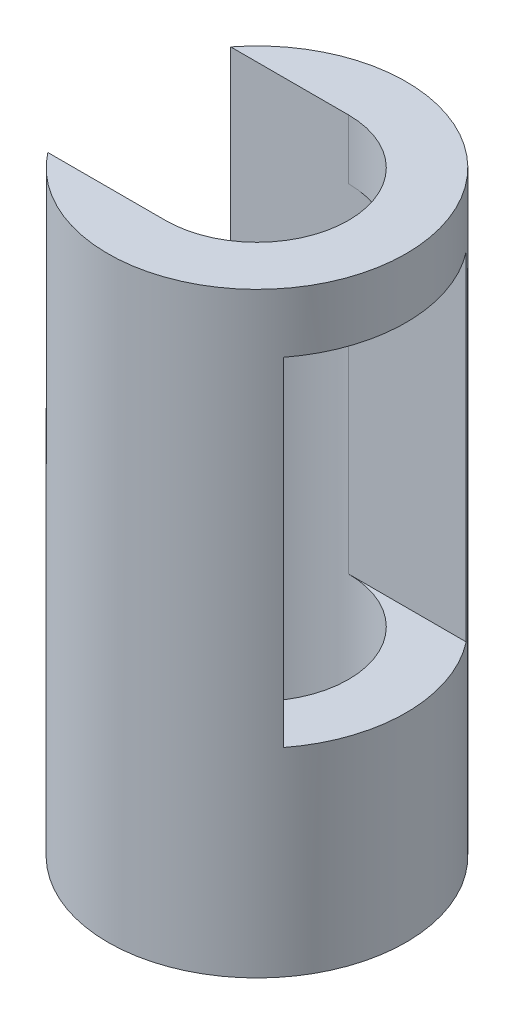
ISO-10303-21;
HEADER;
FILE_DESCRIPTION(('STEP AP214'),'2;1');
FILE_NAME('part.step','',(''),(''),'','','');
FILE_SCHEMA(('AUTOMOTIVE_DESIGN { 1 0 10303 214 1 1 1 1 }'));
ENDSEC;
DATA;
#1=APPLICATION_CONTEXT('core data for automotive mechanical design processes');
#2=APPLICATION_PROTOCOL_DEFINITION('international standard','automotive_design',2000,#1);
#3=PRODUCT_CONTEXT('',#1,'mechanical');
#4=PRODUCT('Part','Part','',(#3));
#5=PRODUCT_RELATED_PRODUCT_CATEGORY('part','',(#4));
#6=PRODUCT_DEFINITION_FORMATION('','',#4);
#7=PRODUCT_DEFINITION_CONTEXT('part definition',#1,'design');
#8=PRODUCT_DEFINITION('design','',#6,#7);
#9=PRODUCT_DEFINITION_SHAPE('','',#8);
#10=(LENGTH_UNIT() NAMED_UNIT(*) SI_UNIT(.MILLI.,.METRE.));
#11=(NAMED_UNIT(*) PLANE_ANGLE_UNIT() SI_UNIT($,.RADIAN.));
#12=(NAMED_UNIT(*) SI_UNIT($,.STERADIAN.) SOLID_ANGLE_UNIT());
#13=UNCERTAINTY_MEASURE_WITH_UNIT(LENGTH_MEASURE(1.E-05),#10,'distance_accuracy_value','');
#14=(GEOMETRIC_REPRESENTATION_CONTEXT(3) GLOBAL_UNCERTAINTY_ASSIGNED_CONTEXT((#13)) GLOBAL_UNIT_ASSIGNED_CONTEXT((#10,
#11,#12)) REPRESENTATION_CONTEXT('',''));
#15=CARTESIAN_POINT('',(0.,0.,0.));
#16=DIRECTION('',(0.,0.,1.));
#17=DIRECTION('',(1.,0.,0.));
#18=AXIS2_PLACEMENT_3D('',#15,#16,#17);
#19=CARTESIAN_POINT('',(0.,10.,0.));
#20=DIRECTION('',(0.,-1.,0.));
#21=DIRECTION('',(0.,0.,-1.));
#22=AXIS2_PLACEMENT_3D('',#19,#20,#21);
#23=CYLINDRICAL_SURFACE('',#22,4.6);
#24=CARTESIAN_POINT('',(0.,30.,0.));
#25=DIRECTION('',(0.,-1.,0.));
#26=DIRECTION('',(0.,0.,1.));
#27=AXIS2_PLACEMENT_3D('',#24,#25,#26);
#28=CIRCLE('',#27,4.6);
#29=CARTESIAN_POINT('',(0.,30.,-4.6));
#30=VERTEX_POINT('',#29);
#31=CARTESIAN_POINT('',(0.,30.,4.6));
#32=VERTEX_POINT('',#31);
#33=EDGE_CURVE('E247',#30,#32,#28,.T.);
#34=ORIENTED_EDGE('',*,*,#33,.F.);
#35=DIRECTION('',(0.,1.,0.));
#36=VECTOR('',#35,1.);
#37=CARTESIAN_POINT('',(0.,21.,-4.6));
#38=LINE('',#37,#36);
#39=CARTESIAN_POINT('',(0.,27.,-4.6));
#40=VERTEX_POINT('',#39);
#41=EDGE_CURVE('E148',#40,#30,#38,.T.);
#42=ORIENTED_EDGE('',*,*,#41,.F.);
#43=CARTESIAN_POINT('',(0.,27.,0.));
#44=DIRECTION('',(0.,-1.,0.));
#45=DIRECTION('',(0.,0.,1.));
#46=AXIS2_PLACEMENT_3D('',#43,#44,#45);
#47=CIRCLE('',#46,4.6);
#48=CARTESIAN_POINT('',(0.,27.,4.6));
#49=VERTEX_POINT('',#48);
#50=EDGE_CURVE('E249',#40,#49,#47,.T.);
#51=ORIENTED_EDGE('',*,*,#50,.T.);
#52=DIRECTION('',(0.,1.,0.));
#53=VECTOR('',#52,1.);
#54=CARTESIAN_POINT('',(0.,21.,4.6));
#55=LINE('',#54,#53);
#56=EDGE_CURVE('E144',#49,#32,#55,.T.);
#57=ORIENTED_EDGE('',*,*,#56,.T.);
#58=EDGE_LOOP('',(#34,#42,#51,#57));
#59=FACE_BOUND('',#58,.T.);
#60=ADVANCED_FACE('F35',(#59),#23,.F.);
#61=CARTESIAN_POINT('',(0.,0.,0.));
#62=DIRECTION('',(0.,1.,0.));
#63=DIRECTION('',(0.,0.,1.));
#64=AXIS2_PLACEMENT_3D('',#61,#62,#63);
#65=CIRCLE('',#64,4.6);
#66=CARTESIAN_POINT('',(0.,0.,4.6));
#67=VERTEX_POINT('',#66);
#68=EDGE_CURVE('E203',#67,#67,#65,.T.);
#69=ORIENTED_EDGE('',*,*,#68,.F.);
#70=EDGE_LOOP('',(#69));
#71=FACE_BOUND('',#70,.T.);
#72=DIRECTION('',(0.,-1.,0.));
#73=VECTOR('',#72,1.);
#74=CARTESIAN_POINT('',(0.,41.8697093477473,-4.6));
#75=LINE('',#74,#73);
#76=CARTESIAN_POINT('',(0.,21.,-4.6));
#77=VERTEX_POINT('',#76);
#78=CARTESIAN_POINT('',(0.,10.,-4.6));
#79=VERTEX_POINT('',#78);
#80=EDGE_CURVE('E234',#77,#79,#75,.T.);
#81=ORIENTED_EDGE('',*,*,#80,.F.);
#82=CARTESIAN_POINT('',(0.,21.,0.));
#83=DIRECTION('',(0.,-1.,0.));
#84=DIRECTION('',(0.,0.,1.));
#85=AXIS2_PLACEMENT_3D('',#82,#83,#84);
#86=CIRCLE('',#85,4.6);
#87=CARTESIAN_POINT('',(-0.802584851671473,21.,-4.52944340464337));
#88=VERTEX_POINT('',#87);
#89=EDGE_CURVE('E137',#88,#77,#86,.T.);
#90=ORIENTED_EDGE('',*,*,#89,.F.);
#91=CARTESIAN_POINT('',(0.,22.,0.));
#92=DIRECTION('',(0.779884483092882,-0.625923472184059,0.));
#93=DIRECTION('',(-0.625923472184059,-0.779884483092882,0.));
#94=AXIS2_PLACEMENT_3D('',#91,#92,#93);
#95=ELLIPSE('',#94,7.34914123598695,4.6);
#96=CARTESIAN_POINT('',(-0.802584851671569,21.,4.52944340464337));
#97=VERTEX_POINT('',#96);
#98=EDGE_CURVE('E222',#88,#97,#95,.F.);
#99=ORIENTED_EDGE('',*,*,#98,.T.);
#100=CARTESIAN_POINT('',(0.,21.,4.6));
#101=VERTEX_POINT('',#100);
#102=EDGE_CURVE('E60',#101,#97,#86,.T.);
#103=ORIENTED_EDGE('',*,*,#102,.F.);
#104=DIRECTION('',(0.,-1.,0.));
#105=VECTOR('',#104,1.);
#106=CARTESIAN_POINT('',(0.,41.8697093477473,4.6));
#107=LINE('',#106,#105);
#108=CARTESIAN_POINT('',(0.,10.,4.6));
#109=VERTEX_POINT('',#108);
#110=EDGE_CURVE('E160',#101,#109,#107,.T.);
#111=ORIENTED_EDGE('',*,*,#110,.T.);
#112=CARTESIAN_POINT('',(0.,10.,0.));
#113=DIRECTION('',(0.,1.,0.));
#114=DIRECTION('',(0.,0.,1.));
#115=AXIS2_PLACEMENT_3D('',#112,#113,#114);
#116=CIRCLE('',#115,4.6);
#117=EDGE_CURVE('E205',#109,#79,#116,.T.);
#118=ORIENTED_EDGE('',*,*,#117,.T.);
#119=EDGE_LOOP('',(#81,#90,#99,#103,#111,#118));
#120=FACE_BOUND('',#119,.T.);
#121=ADVANCED_FACE('F168',(#71,#120),#23,.F.);
#122=CARTESIAN_POINT('',(2.6734191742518,22.5926827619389,0.));
#123=DIRECTION('',(-0.976296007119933,-0.216439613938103,0.));
#124=DIRECTION('',(0.216439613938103,-0.976296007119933,0.));
#125=AXIS2_PLACEMENT_3D('',#122,#123,#124);
#126=CYLINDRICAL_SURFACE('',#125,4.6);
#127=CARTESIAN_POINT('',(-7.5,15.6256042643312,0.));
#128=CARTESIAN_POINT('',(-7.50000050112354,15.6256035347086,0.109330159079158));
#129=CARTESIAN_POINT('',(-7.49760368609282,15.6301342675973,0.218652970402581));
#130=CARTESIAN_POINT('',(-7.48808684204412,15.648162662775,0.436388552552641));
#131=CARTESIAN_POINT('',(-7.48096505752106,15.6616636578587,0.544800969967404));
#132=CARTESIAN_POINT('',(-7.46219761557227,15.6973661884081,0.759763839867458));
#133=CARTESIAN_POINT('',(-7.45055272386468,15.7195662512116,0.866314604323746));
#134=CARTESIAN_POINT('',(-7.42305678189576,15.7722457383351,1.0768118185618));
#135=CARTESIAN_POINT('',(-7.40720377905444,15.8027290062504,1.18075703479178));
#136=CARTESIAN_POINT('',(-7.35414712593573,15.9053932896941,1.48623704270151));
#137=CARTESIAN_POINT('',(-7.31129370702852,15.9890716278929,1.68305123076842));
#138=CARTESIAN_POINT('',(-7.21417368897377,16.1825436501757,2.06004871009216));
#139=CARTESIAN_POINT('',(-7.15990032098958,16.2923528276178,2.24022204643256));
#140=CARTESIAN_POINT('',(-7.02178055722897,16.5794395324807,2.64695346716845));
#141=CARTESIAN_POINT('',(-6.93448923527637,16.7665586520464,2.86546750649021));
#142=CARTESIAN_POINT('',(-6.79981491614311,17.0717466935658,3.16617795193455));
#143=CARTESIAN_POINT('',(-6.75423309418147,17.1777291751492,3.26202160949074));
#144=CARTESIAN_POINT('',(-6.66293067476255,17.3972124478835,3.44467030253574));
#145=CARTESIAN_POINT('',(-6.61721008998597,17.5107125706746,3.53147613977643));
#146=CARTESIAN_POINT('',(-6.5261265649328,17.7463213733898,3.69712703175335));
#147=CARTESIAN_POINT('',(-6.48077938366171,17.8685339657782,3.77583248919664));
#148=CARTESIAN_POINT('',(-6.39241425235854,18.1194979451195,3.92357564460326));
#149=CARTESIAN_POINT('',(-6.34939655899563,18.2482500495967,3.99261227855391));
#150=CARTESIAN_POINT('',(-6.26711812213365,18.5116241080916,4.1205595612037));
#151=CARTESIAN_POINT('',(-6.2278520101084,18.6462372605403,4.17948477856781));
#152=CARTESIAN_POINT('',(-6.1544799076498,18.9209546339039,4.28679281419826));
#153=CARTESIAN_POINT('',(-6.12037476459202,19.0610597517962,4.33517390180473));
#154=CARTESIAN_POINT('',(-6.04227288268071,19.423498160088,4.44382782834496));
#155=CARTESIAN_POINT('',(-6.00290228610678,19.649322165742,4.49638051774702));
#156=CARTESIAN_POINT('',(-5.96034047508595,19.9935218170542,4.55245610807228));
#157=CARTESIAN_POINT('',(-5.94890267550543,20.1091487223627,4.56735522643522));
#158=CARTESIAN_POINT('',(-5.93211342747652,20.3415842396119,4.58914281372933));
#159=CARTESIAN_POINT('',(-5.926759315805,20.4583923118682,4.5960347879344));
#160=CARTESIAN_POINT('',(-5.92257430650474,20.6933055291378,4.60142642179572));
#161=CARTESIAN_POINT('',(-5.92379837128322,20.8114133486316,4.59985537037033));
#162=CARTESIAN_POINT('',(-5.93309849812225,21.046916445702,4.58785362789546));
#163=CARTESIAN_POINT('',(-5.94117450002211,21.1643117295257,4.57742301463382));
#164=CARTESIAN_POINT('',(-5.96406209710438,21.3972858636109,4.54756145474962));
#165=CARTESIAN_POINT('',(-5.97887361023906,21.5128647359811,4.52813061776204));
#166=CARTESIAN_POINT('',(-6.01478824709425,21.7411474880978,4.48031404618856));
#167=CARTESIAN_POINT('',(-6.0358910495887,21.8538515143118,4.45192876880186));
#168=CARTESIAN_POINT('',(-6.08093608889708,22.0628037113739,4.39015939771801));
#169=CARTESIAN_POINT('',(-6.10427907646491,22.159461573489,4.35771601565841));
#170=CARTESIAN_POINT('',(-6.15470527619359,22.3492995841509,4.28620107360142));
#171=CARTESIAN_POINT('',(-6.18178971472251,22.442478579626,4.24712733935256));
#172=CARTESIAN_POINT('',(-6.26761741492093,22.7161336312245,4.12036003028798));
#173=CARTESIAN_POINT('',(-6.33095925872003,22.8908342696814,4.02308861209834));
#174=CARTESIAN_POINT('',(-6.47012006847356,23.237445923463,3.79563877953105));
#175=CARTESIAN_POINT('',(-6.54654998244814,23.4076540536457,3.66327030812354));
#176=CARTESIAN_POINT('',(-6.70024649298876,23.725494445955,3.37394384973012));
#177=CARTESIAN_POINT('',(-6.77751353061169,23.8731141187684,3.21697224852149));
#178=CARTESIAN_POINT('',(-6.8949418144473,24.0863671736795,2.95311832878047));
#179=CARTESIAN_POINT('',(-6.9368692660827,24.1601086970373,2.85343912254));
#180=CARTESIAN_POINT('',(-7.01803726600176,24.2994460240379,2.64752294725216));
#181=CARTESIAN_POINT('',(-7.05727861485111,24.3650442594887,2.54128795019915));
#182=CARTESIAN_POINT('',(-7.13218023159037,24.4878443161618,2.32279034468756));
#183=CARTESIAN_POINT('',(-7.16783858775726,24.5450416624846,2.2105245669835));
#184=CARTESIAN_POINT('',(-7.23471024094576,24.6506713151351,1.98072670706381));
#185=CARTESIAN_POINT('',(-7.2659254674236,24.6991074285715,1.8631969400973));
#186=CARTESIAN_POINT('',(-7.32347615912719,24.7873628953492,1.62239649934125));
#187=CARTESIAN_POINT('',(-7.34976045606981,24.8270925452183,1.49908063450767));
#188=CARTESIAN_POINT('',(-7.39640976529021,24.8970006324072,1.24873009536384));
#189=CARTESIAN_POINT('',(-7.4167772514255,24.927183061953,1.12169699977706));
#190=CARTESIAN_POINT('',(-7.45109253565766,24.9777504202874,0.864869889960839));
#191=CARTESIAN_POINT('',(-7.46504179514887,24.9981375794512,0.735076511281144));
#192=CARTESIAN_POINT('',(-7.48616865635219,25.0289291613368,0.473768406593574));
#193=CARTESIAN_POINT('',(-7.49334673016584,25.0393342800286,0.342253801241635));
#194=CARTESIAN_POINT('',(-7.50048932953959,25.0496864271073,0.0878206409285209));
#195=CARTESIAN_POINT('',(-7.50092196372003,25.0503121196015,-0.035057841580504));
#196=CARTESIAN_POINT('',(-7.49575918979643,25.0428316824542,-0.280464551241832));
#197=CARTESIAN_POINT('',(-7.49016177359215,25.034722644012,-0.402992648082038));
#198=CARTESIAN_POINT('',(-7.4730651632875,25.0098439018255,-0.646692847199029));
#199=CARTESIAN_POINT('',(-7.4615685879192,24.993078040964,-0.767865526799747));
#200=CARTESIAN_POINT('',(-7.43292677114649,24.9510211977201,-1.00808717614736));
#201=CARTESIAN_POINT('',(-7.41577940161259,24.9257270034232,-1.1271353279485));
#202=CARTESIAN_POINT('',(-7.37655511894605,24.8673231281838,-1.36020139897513));
#203=CARTESIAN_POINT('',(-7.35456960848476,24.8343577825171,-1.47427087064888));
#204=CARTESIAN_POINT('',(-7.3059649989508,24.7606109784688,-1.69885456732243));
#205=CARTESIAN_POINT('',(-7.27934423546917,24.7198267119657,-1.80936749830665));
#206=CARTESIAN_POINT('',(-7.19331695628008,24.5861073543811,-2.13454757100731));
#207=CARTESIAN_POINT('',(-7.12771355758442,24.4817598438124,-2.34303831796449));
#208=CARTESIAN_POINT('',(-6.98096042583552,24.2376822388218,-2.75063314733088));
#209=CARTESIAN_POINT('',(-6.89911622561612,24.0962112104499,-2.94843302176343));
#210=CARTESIAN_POINT('',(-6.72993335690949,23.7831629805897,-3.31646979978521));
#211=CARTESIAN_POINT('',(-6.64258974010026,23.6115584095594,-3.48668137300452));
#212=CARTESIAN_POINT('',(-6.51214714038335,23.3288480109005,-3.72163337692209));
#213=CARTESIAN_POINT('',(-6.46777126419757,23.227809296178,-3.79802154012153));
#214=CARTESIAN_POINT('',(-6.38138193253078,23.0183746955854,-3.94143982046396));
#215=CARTESIAN_POINT('',(-6.33936728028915,22.9099825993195,-4.00847470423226));
#216=CARTESIAN_POINT('',(-6.25922431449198,22.6864072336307,-4.13250126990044));
#217=CARTESIAN_POINT('',(-6.2210915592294,22.5712319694,-4.18950448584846));
#218=CARTESIAN_POINT('',(-6.15017123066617,22.3346517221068,-4.29293955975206));
#219=CARTESIAN_POINT('',(-6.11738259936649,22.2132479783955,-4.33937351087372));
#220=CARTESIAN_POINT('',(-6.06162458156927,21.9781005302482,-4.41687059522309));
#221=CARTESIAN_POINT('',(-6.03798812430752,21.8648762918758,-4.44903103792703));
#222=CARTESIAN_POINT('',(-5.99697427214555,21.6351052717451,-4.50416281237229));
#223=CARTESIAN_POINT('',(-5.97959631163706,21.5185587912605,-4.52713497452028));
#224=CARTESIAN_POINT('',(-5.9516882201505,21.2832768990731,-4.56376428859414));
#225=CARTESIAN_POINT('',(-5.94115360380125,21.1645429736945,-4.57742754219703));
#226=CARTESIAN_POINT('',(-5.92714125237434,20.9259988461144,-4.59555328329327));
#227=CARTESIAN_POINT('',(-5.92366321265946,20.8061886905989,-4.60001616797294));
#228=CARTESIAN_POINT('',(-5.92371281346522,20.4775509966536,-4.59997178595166));
#229=CARTESIAN_POINT('',(-5.9343540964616,20.2686396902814,-4.58635086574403));
#230=CARTESIAN_POINT('',(-5.97424200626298,19.8559112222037,-4.53424882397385));
#231=CARTESIAN_POINT('',(-6.00350477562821,19.6520986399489,-4.49574613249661));
#232=CARTESIAN_POINT('',(-6.09189438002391,19.1690721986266,-4.37566769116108));
#233=CARTESIAN_POINT('',(-6.15839175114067,18.8939562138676,-4.28281421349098));
#234=CARTESIAN_POINT('',(-6.27117761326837,18.4978773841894,-4.11423159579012));
#235=CARTESIAN_POINT('',(-6.31101343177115,18.3684414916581,-4.05304363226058));
#236=CARTESIAN_POINT('',(-6.39374911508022,18.1154468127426,-3.92122803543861));
#237=CARTESIAN_POINT('',(-6.43664866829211,17.9918874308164,-3.85060136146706));
#238=CARTESIAN_POINT('',(-6.52507162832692,17.7489424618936,-3.69882308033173));
#239=CARTESIAN_POINT('',(-6.57062872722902,17.6296749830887,-3.6175022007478));
#240=CARTESIAN_POINT('',(-6.66239653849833,17.3983383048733,-3.44557378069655));
#241=CARTESIAN_POINT('',(-6.70860730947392,17.2862697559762,-3.35496540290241));
#242=CARTESIAN_POINT('',(-6.84632452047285,16.9621611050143,-3.06958768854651));
#243=CARTESIAN_POINT('',(-6.93713359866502,16.7616440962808,-2.86091006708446));
#244=CARTESIAN_POINT('',(-7.09005691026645,16.4360780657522,-2.45325164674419));
#245=CARTESIAN_POINT('',(-7.15427212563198,16.3039596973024,-2.26073261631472));
#246=CARTESIAN_POINT('',(-7.24117055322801,16.1286630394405,-1.95617576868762));
#247=CARTESIAN_POINT('',(-7.26857201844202,16.0740327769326,-1.8519971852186));
#248=CARTESIAN_POINT('',(-7.31958841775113,15.973165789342,-1.63878712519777));
#249=CARTESIAN_POINT('',(-7.3432050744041,15.9269252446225,-1.52975788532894));
#250=CARTESIAN_POINT('',(-7.38620509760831,15.8432646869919,-1.30652079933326));
#251=CARTESIAN_POINT('',(-7.40555331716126,15.805917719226,-1.19227867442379));
#252=CARTESIAN_POINT('',(-7.43918867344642,15.7412832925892,-0.960309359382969));
#253=CARTESIAN_POINT('',(-7.45347863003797,15.7139902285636,-0.842584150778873));
#254=CARTESIAN_POINT('',(-7.47653758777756,15.6700655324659,-0.604694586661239));
#255=CARTESIAN_POINT('',(-7.48530999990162,15.6534273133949,-0.484531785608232));
#256=CARTESIAN_POINT('',(-7.49704058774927,15.6311977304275,-0.242909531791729));
#257=CARTESIAN_POINT('',(-7.49999944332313,15.625605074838,-0.121450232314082));
#258=CARTESIAN_POINT('',(-7.5,15.6256042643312,0.));
#259=B_SPLINE_CURVE_WITH_KNOTS('',3,(#127,#128,#129,#130,#131,#132,#133,#134,#135,#136,#137,
#138,#139,#140,#141,#142,#143,#144,#145,#146,#147,#148,#149,#150,#151,#152,#153,#154,#155,#156,
#157,#158,#159,#160,#161,#162,#163,#164,#165,#166,#167,#168,#169,#170,#171,#172,#173,#174,#175,
#176,#177,#178,#179,#180,#181,#182,#183,#184,#185,#186,#187,#188,#189,#190,#191,#192,#193,#194,
#195,#196,#197,#198,#199,#200,#201,#202,#203,#204,#205,#206,#207,#208,#209,#210,#211,#212,#213,
#214,#215,#216,#217,#218,#219,#220,#221,#222,#223,#224,#225,#226,#227,#228,#229,#230,#231,#232,
#233,#234,#235,#236,#237,#238,#239,#240,#241,#242,#243,#244,#245,#246,#247,#248,#249,#250,#251,
#252,#253,#254,#255,#256,#257,#258),.UNSPECIFIED.,.T.,.F.,(4,2,2,2,2,2,2,2,2,2,2,2,2,2,2,2,2,2,
2,2,2,2,2,2,2,2,2,2,2,2,2,2,2,2,2,2,2,2,2,2,2,2,2,2,2,2,2,2,2,2,2,2,2,2,2,2,2,2,2,2,2,2,2,2,2,
4),(0.,0.327858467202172,0.655838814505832,0.983763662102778,1.31184093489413,1.96306234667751,
2.61467084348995,3.51137569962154,3.96100877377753,4.4106019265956,4.86696680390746,
5.32338186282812,5.77913368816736,6.23496026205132,6.9373142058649,7.28839082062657,
7.63931368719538,7.99317314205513,8.34702949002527,8.7008815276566,9.05471550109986,
9.36815222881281,9.68169193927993,10.3084338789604,10.9922516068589,11.6764490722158,
12.0687326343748,12.4608987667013,12.853273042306,13.2454764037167,13.6415482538,
14.0374542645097,14.4332700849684,14.8290583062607,15.197247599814,15.565559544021,
15.9337081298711,16.3019955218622,16.6638455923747,17.0258258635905,17.7492208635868,
18.5158182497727,19.2831155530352,19.6853058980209,20.0872905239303,20.4888098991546,
20.8902496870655,21.2498711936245,21.6094601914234,21.9688132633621,22.3281508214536,
22.9541329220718,23.5806584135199,24.4691022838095,24.9146173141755,25.3600870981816,
25.813726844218,26.2674075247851,27.1726631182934,27.8962060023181,28.2581707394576,
28.6199702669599,28.984646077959,29.3491182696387,29.7133649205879,30.0775689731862),.UNSPECIFIED.);
#260=CARTESIAN_POINT('',(-5.93165972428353,21.,-4.58970727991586));
#261=VERTEX_POINT('',#260);
#262=CARTESIAN_POINT('',(-5.93165972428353,21.,4.58970727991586));
#263=VERTEX_POINT('',#262);
#264=EDGE_CURVE('E155',#261,#263,#259,.T.);
#265=ORIENTED_EDGE('',*,*,#264,.T.);
#266=CARTESIAN_POINT('',(-4.51070850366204,21.,0.));
#267=DIRECTION('',(0.,1.,0.));
#268=DIRECTION('',(-1.,0.,0.));
#269=AXIS2_PLACEMENT_3D('',#266,#267,#268);
#270=ELLIPSE('',#269,21.2530410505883,4.6);
#271=CARTESIAN_POINT('',(-4.51070850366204,21.,4.6));
#272=VERTEX_POINT('',#271);
#273=EDGE_CURVE('E11',#263,#272,#270,.T.);
#274=ORIENTED_EDGE('',*,*,#273,.T.);
#275=EDGE_CURVE('E45',#272,#97,#270,.T.);
#276=ORIENTED_EDGE('',*,*,#275,.T.);
#277=ORIENTED_EDGE('',*,*,#98,.F.);
#278=CARTESIAN_POINT('',(-4.51070850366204,21.,-4.6));
#279=VERTEX_POINT('',#278);
#280=EDGE_CURVE('E227',#88,#279,#270,.T.);
#281=ORIENTED_EDGE('',*,*,#280,.T.);
#282=EDGE_CURVE('E40',#279,#261,#270,.T.);
#283=ORIENTED_EDGE('',*,*,#282,.T.);
#284=EDGE_LOOP('',(#265,#274,#276,#277,#281,#283));
#285=FACE_BOUND('',#284,.T.);
#286=ADVANCED_FACE('F163',(#285),#126,.F.);
#287=CARTESIAN_POINT('',(0.,10.,0.));
#288=DIRECTION('',(0.,-1.,0.));
#289=DIRECTION('',(0.,0.,-1.));
#290=AXIS2_PLACEMENT_3D('',#287,#288,#289);
#291=CYLINDRICAL_SURFACE('',#290,7.5);
#292=CARTESIAN_POINT('',(0.,0.,0.));
#293=DIRECTION('',(0.,1.,0.));
#294=DIRECTION('',(0.,0.,1.));
#295=AXIS2_PLACEMENT_3D('',#292,#293,#294);
#296=CIRCLE('',#295,7.5);
#297=CARTESIAN_POINT('',(0.,0.,7.5));
#298=VERTEX_POINT('',#297);
#299=EDGE_CURVE('E200',#298,#298,#296,.T.);
#300=ORIENTED_EDGE('',*,*,#299,.T.);
#301=EDGE_LOOP('',(#300));
#302=FACE_BOUND('',#301,.T.);
#303=CARTESIAN_POINT('',(0.,21.,0.));
#304=DIRECTION('',(0.,1.,0.));
#305=DIRECTION('',(0.,0.,1.));
#306=AXIS2_PLACEMENT_3D('',#303,#304,#305);
#307=CIRCLE('',#306,7.5);
#308=CARTESIAN_POINT('',(-5.92368128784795,21.,-4.6));
#309=VERTEX_POINT('',#308);
#310=EDGE_CURVE('E52',#309,#261,#307,.T.);
#311=ORIENTED_EDGE('',*,*,#310,.F.);
#312=DIRECTION('',(0.,1.,0.));
#313=VECTOR('',#312,1.);
#314=CARTESIAN_POINT('',(-5.92368128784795,21.,-4.6));
#315=LINE('',#314,#313);
#316=CARTESIAN_POINT('',(-5.92368128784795,30.,-4.6));
#317=VERTEX_POINT('',#316);
#318=EDGE_CURVE('E161',#309,#317,#315,.T.);
#319=ORIENTED_EDGE('',*,*,#318,.T.);
#320=CARTESIAN_POINT('',(0.,30.,0.));
#321=DIRECTION('',(0.,1.,0.));
#322=DIRECTION('',(0.,0.,1.));
#323=AXIS2_PLACEMENT_3D('',#320,#321,#322);
#324=CIRCLE('',#323,7.5);
#325=CARTESIAN_POINT('',(-5.92368128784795,30.,4.6));
#326=VERTEX_POINT('',#325);
#327=EDGE_CURVE('E143',#326,#317,#324,.T.);
#328=ORIENTED_EDGE('',*,*,#327,.F.);
#329=DIRECTION('',(0.,1.,0.));
#330=VECTOR('',#329,1.);
#331=CARTESIAN_POINT('',(-5.92368128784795,21.,4.6));
#332=LINE('',#331,#330);
#333=CARTESIAN_POINT('',(-5.92368128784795,21.,4.6));
#334=VERTEX_POINT('',#333);
#335=EDGE_CURVE('E133',#334,#326,#332,.T.);
#336=ORIENTED_EDGE('',*,*,#335,.F.);
#337=EDGE_CURVE('E120',#263,#334,#307,.T.);
#338=ORIENTED_EDGE('',*,*,#337,.F.);
#339=ORIENTED_EDGE('',*,*,#264,.F.);
#340=EDGE_LOOP('',(#311,#319,#328,#336,#338,#339));
#341=FACE_BOUND('',#340,.T.);
#342=CARTESIAN_POINT('',(0.,27.,0.));
#343=DIRECTION('',(0.,1.,0.));
#344=DIRECTION('',(0.,0.,1.));
#345=AXIS2_PLACEMENT_3D('',#342,#343,#344);
#346=CIRCLE('',#345,7.5);
#347=CARTESIAN_POINT('',(5.92368128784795,27.,4.6));
#348=VERTEX_POINT('',#347);
#349=CARTESIAN_POINT('',(5.92368128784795,27.,-4.6));
#350=VERTEX_POINT('',#349);
#351=EDGE_CURVE('E243',#348,#350,#346,.T.);
#352=ORIENTED_EDGE('',*,*,#351,.T.);
#353=DIRECTION('',(0.,-1.,0.));
#354=VECTOR('',#353,1.);
#355=CARTESIAN_POINT('',(5.92368128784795,30.,-4.6));
#356=LINE('',#355,#354);
#357=CARTESIAN_POINT('',(5.92368128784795,10.,-4.6));
#358=VERTEX_POINT('',#357);
#359=EDGE_CURVE('E206',#350,#358,#356,.T.);
#360=ORIENTED_EDGE('',*,*,#359,.T.);
#361=CARTESIAN_POINT('',(0.,10.,0.));
#362=DIRECTION('',(0.,1.,0.));
#363=DIRECTION('',(0.,0.,1.));
#364=AXIS2_PLACEMENT_3D('',#361,#362,#363);
#365=CIRCLE('',#364,7.5);
#366=CARTESIAN_POINT('',(5.92368128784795,10.,4.6));
#367=VERTEX_POINT('',#366);
#368=EDGE_CURVE('E214',#367,#358,#365,.T.);
#369=ORIENTED_EDGE('',*,*,#368,.F.);
#370=DIRECTION('',(0.,-1.,0.));
#371=VECTOR('',#370,1.);
#372=CARTESIAN_POINT('',(5.92368128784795,30.,4.6));
#373=LINE('',#372,#371);
#374=EDGE_CURVE('E242',#348,#367,#373,.T.);
#375=ORIENTED_EDGE('',*,*,#374,.F.);
#376=EDGE_LOOP('',(#352,#360,#369,#375));
#377=FACE_BOUND('',#376,.T.);
#378=ADVANCED_FACE('F37',(#302,#341,#377),#291,.T.);
#379=CARTESIAN_POINT('',(-5.92368128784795,30.,4.6));
#380=DIRECTION('',(0.,0.,1.));
#381=DIRECTION('',(1.,0.,0.));
#382=AXIS2_PLACEMENT_3D('',#379,#380,#381);
#383=PLANE('',#382);
#384=ORIENTED_EDGE('',*,*,#56,.F.);
#385=DIRECTION('',(1.,0.,0.));
#386=VECTOR('',#385,1.);
#387=CARTESIAN_POINT('',(5.92368128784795,27.,4.6));
#388=LINE('',#387,#386);
#389=EDGE_CURVE('E256',#49,#348,#388,.T.);
#390=ORIENTED_EDGE('',*,*,#389,.T.);
#391=ORIENTED_EDGE('',*,*,#374,.T.);
#392=DIRECTION('',(-1.,0.,0.));
#393=VECTOR('',#392,1.);
#394=CARTESIAN_POINT('',(-5.92368128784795,10.,4.6));
#395=LINE('',#394,#393);
#396=EDGE_CURVE('E239',#367,#109,#395,.T.);
#397=ORIENTED_EDGE('',*,*,#396,.T.);
#398=ORIENTED_EDGE('',*,*,#110,.F.);
#399=DIRECTION('',(1.,0.,0.));
#400=VECTOR('',#399,1.);
#401=CARTESIAN_POINT('',(-5.92368128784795,21.,4.6));
#402=LINE('',#401,#400);
#403=EDGE_CURVE('E136',#272,#101,#402,.T.);
#404=ORIENTED_EDGE('',*,*,#403,.F.);
#405=EDGE_CURVE('E123',#334,#272,#402,.T.);
#406=ORIENTED_EDGE('',*,*,#405,.F.);
#407=ORIENTED_EDGE('',*,*,#335,.T.);
#408=DIRECTION('',(1.,0.,0.));
#409=VECTOR('',#408,1.);
#410=CARTESIAN_POINT('',(-5.92368128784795,30.,4.6));
#411=LINE('',#410,#409);
#412=EDGE_CURVE('E263',#326,#32,#411,.T.);
#413=ORIENTED_EDGE('',*,*,#412,.T.);
#414=EDGE_LOOP('',(#384,#390,#391,#397,#398,#404,#406,#407,#413));
#415=FACE_BOUND('',#414,.T.);
#416=ADVANCED_FACE('F132',(#415),#383,.F.);
#417=CARTESIAN_POINT('',(0.,30.,-4.6));
#418=DIRECTION('',(0.,0.,-1.));
#419=DIRECTION('',(-1.,0.,0.));
#420=AXIS2_PLACEMENT_3D('',#417,#418,#419);
#421=PLANE('',#420);
#422=DIRECTION('',(-1.,0.,0.));
#423=VECTOR('',#422,1.);
#424=CARTESIAN_POINT('',(0.,27.,-4.6));
#425=LINE('',#424,#423);
#426=EDGE_CURVE('E246',#350,#40,#425,.T.);
#427=ORIENTED_EDGE('',*,*,#426,.T.);
#428=ORIENTED_EDGE('',*,*,#41,.T.);
#429=DIRECTION('',(-1.,0.,0.));
#430=VECTOR('',#429,1.);
#431=CARTESIAN_POINT('',(0.,30.,-4.6));
#432=LINE('',#431,#430);
#433=EDGE_CURVE('E128',#30,#317,#432,.T.);
#434=ORIENTED_EDGE('',*,*,#433,.T.);
#435=ORIENTED_EDGE('',*,*,#318,.F.);
#436=DIRECTION('',(-1.,0.,0.));
#437=VECTOR('',#436,1.);
#438=CARTESIAN_POINT('',(0.,21.,-4.6));
#439=LINE('',#438,#437);
#440=EDGE_CURVE('E151',#279,#309,#439,.T.);
#441=ORIENTED_EDGE('',*,*,#440,.F.);
#442=EDGE_CURVE('E145',#77,#279,#439,.T.);
#443=ORIENTED_EDGE('',*,*,#442,.F.);
#444=ORIENTED_EDGE('',*,*,#80,.T.);
#445=DIRECTION('',(1.,0.,0.));
#446=VECTOR('',#445,1.);
#447=CARTESIAN_POINT('',(0.,10.,-4.6));
#448=LINE('',#447,#446);
#449=EDGE_CURVE('E217',#79,#358,#448,.T.);
#450=ORIENTED_EDGE('',*,*,#449,.T.);
#451=ORIENTED_EDGE('',*,*,#359,.F.);
#452=EDGE_LOOP('',(#427,#428,#434,#435,#441,#443,#444,#450,#451));
#453=FACE_BOUND('',#452,.T.);
#454=ADVANCED_FACE('F179',(#453),#421,.F.);
#455=CARTESIAN_POINT('',(0.,10.,0.));
#456=DIRECTION('',(0.,1.,0.));
#457=DIRECTION('',(0.,0.,1.));
#458=AXIS2_PLACEMENT_3D('',#455,#456,#457);
#459=PLANE('',#458);
#460=ORIENTED_EDGE('',*,*,#117,.F.);
#461=ORIENTED_EDGE('',*,*,#396,.F.);
#462=ORIENTED_EDGE('',*,*,#368,.T.);
#463=ORIENTED_EDGE('',*,*,#449,.F.);
#464=EDGE_LOOP('',(#460,#461,#462,#463));
#465=FACE_BOUND('',#464,.T.);
#466=ADVANCED_FACE('F186',(#465),#459,.T.);
#467=CARTESIAN_POINT('',(0.,0.,0.));
#468=DIRECTION('',(0.,1.,0.));
#469=DIRECTION('',(0.,0.,1.));
#470=AXIS2_PLACEMENT_3D('',#467,#468,#469);
#471=PLANE('',#470);
#472=ORIENTED_EDGE('',*,*,#299,.F.);
#473=EDGE_LOOP('',(#472));
#474=FACE_BOUND('',#473,.T.);
#475=ORIENTED_EDGE('',*,*,#68,.T.);
#476=EDGE_LOOP('',(#475));
#477=FACE_BOUND('',#476,.T.);
#478=ADVANCED_FACE('F182',(#474,#477),#471,.F.);
#479=CARTESIAN_POINT('',(0.,30.,0.));
#480=DIRECTION('',(0.,1.,0.));
#481=DIRECTION('',(0.,0.,1.));
#482=AXIS2_PLACEMENT_3D('',#479,#480,#481);
#483=PLANE('',#482);
#484=ORIENTED_EDGE('',*,*,#433,.F.);
#485=ORIENTED_EDGE('',*,*,#33,.T.);
#486=ORIENTED_EDGE('',*,*,#412,.F.);
#487=ORIENTED_EDGE('',*,*,#327,.T.);
#488=EDGE_LOOP('',(#484,#485,#486,#487));
#489=FACE_BOUND('',#488,.T.);
#490=ADVANCED_FACE('F175',(#489),#483,.T.);
#491=CARTESIAN_POINT('',(0.,27.,0.));
#492=DIRECTION('',(0.,1.,0.));
#493=DIRECTION('',(0.,0.,1.));
#494=AXIS2_PLACEMENT_3D('',#491,#492,#493);
#495=PLANE('',#494);
#496=ORIENTED_EDGE('',*,*,#351,.F.);
#497=ORIENTED_EDGE('',*,*,#389,.F.);
#498=ORIENTED_EDGE('',*,*,#50,.F.);
#499=ORIENTED_EDGE('',*,*,#426,.F.);
#500=EDGE_LOOP('',(#496,#497,#498,#499));
#501=FACE_BOUND('',#500,.T.);
#502=ADVANCED_FACE('F171',(#501),#495,.F.);
#503=CARTESIAN_POINT('',(0.,21.,0.));
#504=DIRECTION('',(0.,1.,0.));
#505=DIRECTION('',(0.,0.,1.));
#506=AXIS2_PLACEMENT_3D('',#503,#504,#505);
#507=PLANE('',#506);
#508=ORIENTED_EDGE('',*,*,#89,.T.);
#509=ORIENTED_EDGE('',*,*,#442,.T.);
#510=ORIENTED_EDGE('',*,*,#280,.F.);
#511=EDGE_LOOP('',(#508,#509,#510));
#512=FACE_BOUND('',#511,.T.);
#513=ADVANCED_FACE('F174',(#512),#507,.T.);
#514=ORIENTED_EDGE('',*,*,#440,.T.);
#515=ORIENTED_EDGE('',*,*,#310,.T.);
#516=ORIENTED_EDGE('',*,*,#282,.F.);
#517=EDGE_LOOP('',(#514,#515,#516));
#518=FACE_BOUND('',#517,.T.);
#519=ADVANCED_FACE('F170',(#518),#507,.T.);
#520=ORIENTED_EDGE('',*,*,#337,.T.);
#521=ORIENTED_EDGE('',*,*,#405,.T.);
#522=ORIENTED_EDGE('',*,*,#273,.F.);
#523=EDGE_LOOP('',(#520,#521,#522));
#524=FACE_BOUND('',#523,.T.);
#525=ADVANCED_FACE('F122',(#524),#507,.T.);
#526=ORIENTED_EDGE('',*,*,#403,.T.);
#527=ORIENTED_EDGE('',*,*,#102,.T.);
#528=ORIENTED_EDGE('',*,*,#275,.F.);
#529=EDGE_LOOP('',(#526,#527,#528));
#530=FACE_BOUND('',#529,.T.);
#531=ADVANCED_FACE('F270',(#530),#507,.T.);
#532=CLOSED_SHELL('',(#60,#121,#286,#378,#416,#454,#466,#478,#490,#502,#513,#519,#525,#531));
#533=MANIFOLD_SOLID_BREP('B2',#532);
#534=ADVANCED_BREP_SHAPE_REPRESENTATION('',(#18,#533),#14);
#535=SHAPE_DEFINITION_REPRESENTATION(#9,#534);
ENDSEC;
END-ISO-10303-21;
